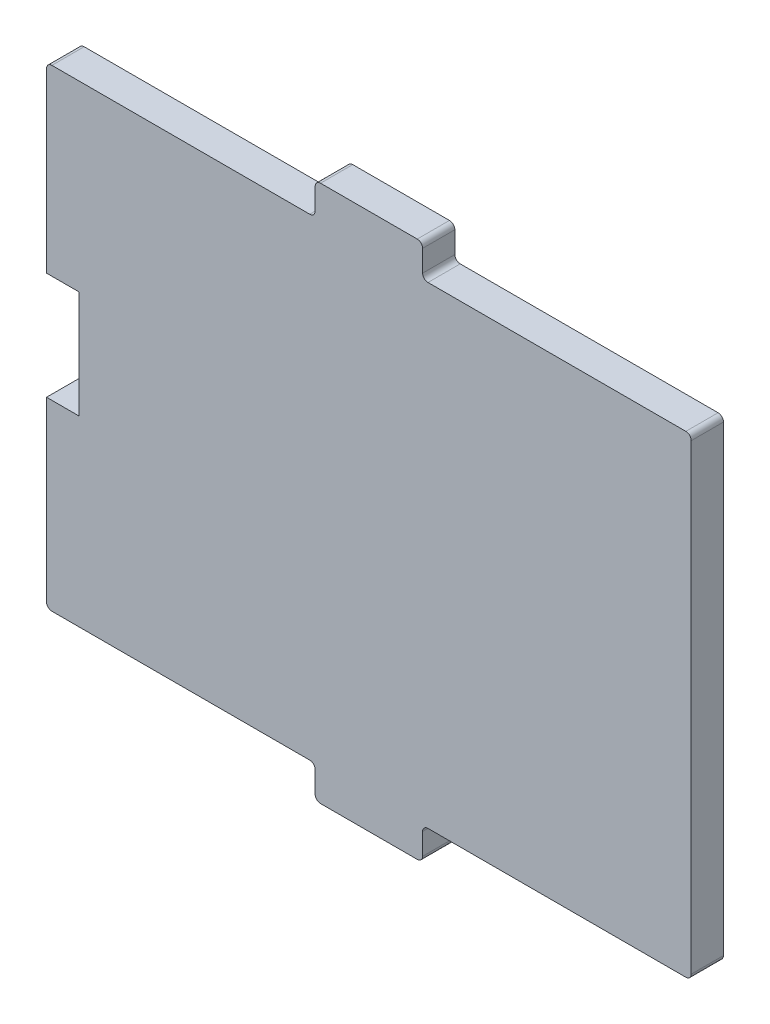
ISO-10303-21;
HEADER;
FILE_DESCRIPTION(('STEP AP214'),'2;1');
FILE_NAME('part.step','',(''),(''),'','','');
FILE_SCHEMA(('AUTOMOTIVE_DESIGN { 1 0 10303 214 1 1 1 1 }'));
ENDSEC;
DATA;
#1=APPLICATION_CONTEXT('core data for automotive mechanical design processes');
#2=APPLICATION_PROTOCOL_DEFINITION('international standard','automotive_design',2000,#1);
#3=PRODUCT_CONTEXT('',#1,'mechanical');
#4=PRODUCT('Part','Part','',(#3));
#5=PRODUCT_RELATED_PRODUCT_CATEGORY('part','',(#4));
#6=PRODUCT_DEFINITION_FORMATION('','',#4);
#7=PRODUCT_DEFINITION_CONTEXT('part definition',#1,'design');
#8=PRODUCT_DEFINITION('design','',#6,#7);
#9=PRODUCT_DEFINITION_SHAPE('','',#8);
#10=(LENGTH_UNIT() NAMED_UNIT(*) SI_UNIT(.MILLI.,.METRE.));
#11=(NAMED_UNIT(*) PLANE_ANGLE_UNIT() SI_UNIT($,.RADIAN.));
#12=(NAMED_UNIT(*) SI_UNIT($,.STERADIAN.) SOLID_ANGLE_UNIT());
#13=UNCERTAINTY_MEASURE_WITH_UNIT(LENGTH_MEASURE(1.E-05),#10,'distance_accuracy_value','');
#14=(GEOMETRIC_REPRESENTATION_CONTEXT(3) GLOBAL_UNCERTAINTY_ASSIGNED_CONTEXT((#13)) GLOBAL_UNIT_ASSIGNED_CONTEXT((#10,
#11,#12)) REPRESENTATION_CONTEXT('',''));
#15=CARTESIAN_POINT('',(0.,0.,0.));
#16=DIRECTION('',(0.,0.,1.));
#17=DIRECTION('',(1.,0.,0.));
#18=AXIS2_PLACEMENT_3D('',#15,#16,#17);
#19=CARTESIAN_POINT('',(-60.,6.,6.));
#20=DIRECTION('',(1.,0.,0.));
#21=DIRECTION('',(0.,0.,-1.));
#22=AXIS2_PLACEMENT_3D('',#19,#20,#21);
#23=PLANE('',#22);
#24=DIRECTION('',(0.,-1.,0.));
#25=VECTOR('',#24,1.);
#26=CARTESIAN_POINT('',(-60.,6.,6.));
#27=LINE('',#26,#25);
#28=CARTESIAN_POINT('',(-60.,40.,6.));
#29=VERTEX_POINT('',#28);
#30=CARTESIAN_POINT('',(-60.,7.,6.));
#31=VERTEX_POINT('',#30);
#32=EDGE_CURVE('E250',#29,#31,#27,.T.);
#33=ORIENTED_EDGE('',*,*,#32,.F.);
#34=DIRECTION('',(0.,0.,-1.));
#35=VECTOR('',#34,1.);
#36=CARTESIAN_POINT('',(-60.,40.,6.));
#37=LINE('',#36,#35);
#38=CARTESIAN_POINT('',(-60.,40.,0.));
#39=VERTEX_POINT('',#38);
#40=EDGE_CURVE('E277',#29,#39,#37,.T.);
#41=ORIENTED_EDGE('',*,*,#40,.T.);
#42=DIRECTION('',(0.,-1.,0.));
#43=VECTOR('',#42,1.);
#44=CARTESIAN_POINT('',(-60.,6.,0.));
#45=LINE('',#44,#43);
#46=CARTESIAN_POINT('',(-60.,7.,0.));
#47=VERTEX_POINT('',#46);
#48=EDGE_CURVE('E289',#39,#47,#45,.T.);
#49=ORIENTED_EDGE('',*,*,#48,.T.);
#50=DIRECTION('',(0.,0.,-1.));
#51=VECTOR('',#50,1.);
#52=CARTESIAN_POINT('',(-60.,7.,6.));
#53=LINE('',#52,#51);
#54=EDGE_CURVE('E376',#47,#31,#53,.F.);
#55=ORIENTED_EDGE('',*,*,#54,.T.);
#56=EDGE_LOOP('',(#33,#41,#49,#55));
#57=FACE_BOUND('',#56,.T.);
#58=ADVANCED_FACE('F39',(#57),#23,.F.);
#59=CARTESIAN_POINT('',(60.,94.,6.));
#60=DIRECTION('',(0.,-1.,0.));
#61=DIRECTION('',(1.,0.,0.));
#62=AXIS2_PLACEMENT_3D('',#59,#60,#61);
#63=PLANE('',#62);
#64=DIRECTION('',(-1.,0.,0.));
#65=VECTOR('',#64,1.);
#66=CARTESIAN_POINT('',(60.,94.,6.));
#67=LINE('',#66,#65);
#68=CARTESIAN_POINT('',(59.,94.,6.));
#69=VERTEX_POINT('',#68);
#70=CARTESIAN_POINT('',(11.,94.,6.));
#71=VERTEX_POINT('',#70);
#72=EDGE_CURVE('E308',#69,#71,#67,.T.);
#73=ORIENTED_EDGE('',*,*,#72,.F.);
#74=DIRECTION('',(0.,0.,-1.));
#75=VECTOR('',#74,1.);
#76=CARTESIAN_POINT('',(59.,94.,6.));
#77=LINE('',#76,#75);
#78=CARTESIAN_POINT('',(59.,94.,0.));
#79=VERTEX_POINT('',#78);
#80=EDGE_CURVE('E371',#69,#79,#77,.T.);
#81=ORIENTED_EDGE('',*,*,#80,.T.);
#82=DIRECTION('',(-1.,0.,0.));
#83=VECTOR('',#82,1.);
#84=CARTESIAN_POINT('',(60.,94.,0.));
#85=LINE('',#84,#83);
#86=CARTESIAN_POINT('',(11.,94.,0.));
#87=VERTEX_POINT('',#86);
#88=EDGE_CURVE('E273',#79,#87,#85,.T.);
#89=ORIENTED_EDGE('',*,*,#88,.T.);
#90=DIRECTION('',(0.,0.,-1.));
#91=VECTOR('',#90,1.);
#92=CARTESIAN_POINT('',(11.,94.,6.));
#93=LINE('',#92,#91);
#94=EDGE_CURVE('E369',#87,#71,#93,.F.);
#95=ORIENTED_EDGE('',*,*,#94,.T.);
#96=EDGE_LOOP('',(#73,#81,#89,#95));
#97=FACE_BOUND('',#96,.T.);
#98=ADVANCED_FACE('F420',(#97),#63,.F.);
#99=CARTESIAN_POINT('',(10.,94.,6.));
#100=DIRECTION('',(-1.,0.,0.));
#101=DIRECTION('',(0.,0.,1.));
#102=AXIS2_PLACEMENT_3D('',#99,#100,#101);
#103=PLANE('',#102);
#104=DIRECTION('',(0.,1.,0.));
#105=VECTOR('',#104,1.);
#106=CARTESIAN_POINT('',(10.,94.,0.));
#107=LINE('',#106,#105);
#108=CARTESIAN_POINT('',(10.,95.,0.));
#109=VERTEX_POINT('',#108);
#110=CARTESIAN_POINT('',(10.,99.,0.));
#111=VERTEX_POINT('',#110);
#112=EDGE_CURVE('E276',#109,#111,#107,.T.);
#113=ORIENTED_EDGE('',*,*,#112,.T.);
#114=DIRECTION('',(0.,0.,-1.));
#115=VECTOR('',#114,1.);
#116=CARTESIAN_POINT('',(10.,99.,6.));
#117=LINE('',#116,#115);
#118=CARTESIAN_POINT('',(10.,99.,6.));
#119=VERTEX_POINT('',#118);
#120=EDGE_CURVE('E397',#111,#119,#117,.F.);
#121=ORIENTED_EDGE('',*,*,#120,.T.);
#122=DIRECTION('',(0.,1.,0.));
#123=VECTOR('',#122,1.);
#124=CARTESIAN_POINT('',(10.,94.,6.));
#125=LINE('',#124,#123);
#126=CARTESIAN_POINT('',(10.,95.,6.));
#127=VERTEX_POINT('',#126);
#128=EDGE_CURVE('E426',#127,#119,#125,.T.);
#129=ORIENTED_EDGE('',*,*,#128,.F.);
#130=DIRECTION('',(0.,0.,-1.));
#131=VECTOR('',#130,1.);
#132=CARTESIAN_POINT('',(10.,95.,0.));
#133=LINE('',#132,#131);
#134=EDGE_CURVE('E394',#127,#109,#133,.T.);
#135=ORIENTED_EDGE('',*,*,#134,.T.);
#136=EDGE_LOOP('',(#113,#121,#129,#135));
#137=FACE_BOUND('',#136,.T.);
#138=ADVANCED_FACE('F429',(#137),#103,.F.);
#139=CARTESIAN_POINT('',(10.,100.,6.));
#140=DIRECTION('',(0.,-1.,0.));
#141=DIRECTION('',(0.,0.,-1.));
#142=AXIS2_PLACEMENT_3D('',#139,#140,#141);
#143=PLANE('',#142);
#144=DIRECTION('',(-1.,0.,0.));
#145=VECTOR('',#144,1.);
#146=CARTESIAN_POINT('',(10.,100.,0.));
#147=LINE('',#146,#145);
#148=CARTESIAN_POINT('',(9.,100.,0.));
#149=VERTEX_POINT('',#148);
#150=CARTESIAN_POINT('',(-9.,100.,0.));
#151=VERTEX_POINT('',#150);
#152=EDGE_CURVE('E280',#149,#151,#147,.T.);
#153=ORIENTED_EDGE('',*,*,#152,.T.);
#154=DIRECTION('',(0.,0.,-1.));
#155=VECTOR('',#154,1.);
#156=CARTESIAN_POINT('',(-9.,100.,6.));
#157=LINE('',#156,#155);
#158=CARTESIAN_POINT('',(-9.,100.,6.));
#159=VERTEX_POINT('',#158);
#160=EDGE_CURVE('E392',#151,#159,#157,.F.);
#161=ORIENTED_EDGE('',*,*,#160,.T.);
#162=DIRECTION('',(-1.,0.,0.));
#163=VECTOR('',#162,1.);
#164=CARTESIAN_POINT('',(10.,100.,6.));
#165=LINE('',#164,#163);
#166=CARTESIAN_POINT('',(9.,100.,6.));
#167=VERTEX_POINT('',#166);
#168=EDGE_CURVE('E431',#167,#159,#165,.T.);
#169=ORIENTED_EDGE('',*,*,#168,.F.);
#170=DIRECTION('',(0.,0.,-1.));
#171=VECTOR('',#170,1.);
#172=CARTESIAN_POINT('',(9.,100.,6.));
#173=LINE('',#172,#171);
#174=EDGE_CURVE('E389',#167,#149,#173,.T.);
#175=ORIENTED_EDGE('',*,*,#174,.T.);
#176=EDGE_LOOP('',(#153,#161,#169,#175));
#177=FACE_BOUND('',#176,.T.);
#178=ADVANCED_FACE('F552',(#177),#143,.F.);
#179=CARTESIAN_POINT('',(-10.,94.,6.));
#180=DIRECTION('',(1.,0.,0.));
#181=DIRECTION('',(0.,0.,-1.));
#182=AXIS2_PLACEMENT_3D('',#179,#180,#181);
#183=PLANE('',#182);
#184=DIRECTION('',(0.,-1.,0.));
#185=VECTOR('',#184,1.);
#186=CARTESIAN_POINT('',(-10.,94.,6.));
#187=LINE('',#186,#185);
#188=CARTESIAN_POINT('',(-10.,99.,6.));
#189=VERTEX_POINT('',#188);
#190=CARTESIAN_POINT('',(-10.,95.,6.));
#191=VERTEX_POINT('',#190);
#192=EDGE_CURVE('E434',#189,#191,#187,.T.);
#193=ORIENTED_EDGE('',*,*,#192,.F.);
#194=DIRECTION('',(0.,0.,-1.));
#195=VECTOR('',#194,1.);
#196=CARTESIAN_POINT('',(-10.,99.,6.));
#197=LINE('',#196,#195);
#198=CARTESIAN_POINT('',(-10.,99.,0.));
#199=VERTEX_POINT('',#198);
#200=EDGE_CURVE('E386',#189,#199,#197,.T.);
#201=ORIENTED_EDGE('',*,*,#200,.T.);
#202=DIRECTION('',(0.,-1.,0.));
#203=VECTOR('',#202,1.);
#204=CARTESIAN_POINT('',(-10.,94.,0.));
#205=LINE('',#204,#203);
#206=CARTESIAN_POINT('',(-10.,95.,0.));
#207=VERTEX_POINT('',#206);
#208=EDGE_CURVE('E283',#199,#207,#205,.T.);
#209=ORIENTED_EDGE('',*,*,#208,.T.);
#210=DIRECTION('',(0.,0.,-1.));
#211=VECTOR('',#210,1.);
#212=CARTESIAN_POINT('',(-10.,95.,6.));
#213=LINE('',#212,#211);
#214=EDGE_CURVE('E384',#207,#191,#213,.F.);
#215=ORIENTED_EDGE('',*,*,#214,.T.);
#216=EDGE_LOOP('',(#193,#201,#209,#215));
#217=FACE_BOUND('',#216,.T.);
#218=ADVANCED_FACE('F548',(#217),#183,.F.);
#219=CARTESIAN_POINT('',(-60.,94.,6.));
#220=DIRECTION('',(0.,-1.,0.));
#221=DIRECTION('',(1.,0.,0.));
#222=AXIS2_PLACEMENT_3D('',#219,#220,#221);
#223=PLANE('',#222);
#224=DIRECTION('',(-1.,0.,0.));
#225=VECTOR('',#224,1.);
#226=CARTESIAN_POINT('',(-60.,94.,0.));
#227=LINE('',#226,#225);
#228=CARTESIAN_POINT('',(-11.,94.,0.));
#229=VERTEX_POINT('',#228);
#230=CARTESIAN_POINT('',(-59.,94.,0.));
#231=VERTEX_POINT('',#230);
#232=EDGE_CURVE('E286',#229,#231,#227,.T.);
#233=ORIENTED_EDGE('',*,*,#232,.T.);
#234=DIRECTION('',(0.,0.,-1.));
#235=VECTOR('',#234,1.);
#236=CARTESIAN_POINT('',(-59.,94.,6.));
#237=LINE('',#236,#235);
#238=CARTESIAN_POINT('',(-59.,94.,6.));
#239=VERTEX_POINT('',#238);
#240=EDGE_CURVE('E382',#231,#239,#237,.F.);
#241=ORIENTED_EDGE('',*,*,#240,.T.);
#242=DIRECTION('',(-1.,0.,0.));
#243=VECTOR('',#242,1.);
#244=CARTESIAN_POINT('',(-60.,94.,6.));
#245=LINE('',#244,#243);
#246=CARTESIAN_POINT('',(-11.,94.,6.));
#247=VERTEX_POINT('',#246);
#248=EDGE_CURVE('E255',#247,#239,#245,.T.);
#249=ORIENTED_EDGE('',*,*,#248,.F.);
#250=DIRECTION('',(0.,0.,-1.));
#251=VECTOR('',#250,1.);
#252=CARTESIAN_POINT('',(-11.,94.,0.));
#253=LINE('',#252,#251);
#254=EDGE_CURVE('E379',#247,#229,#253,.T.);
#255=ORIENTED_EDGE('',*,*,#254,.T.);
#256=EDGE_LOOP('',(#233,#241,#249,#255));
#257=FACE_BOUND('',#256,.T.);
#258=ADVANCED_FACE('F542',(#257),#223,.F.);
#259=CARTESIAN_POINT('',(-60.,93.,0.));
#260=VERTEX_POINT('',#259);
#261=CARTESIAN_POINT('',(-60.,60.,0.));
#262=VERTEX_POINT('',#261);
#263=EDGE_CURVE('E242',#260,#262,#45,.T.);
#264=ORIENTED_EDGE('',*,*,#263,.T.);
#265=DIRECTION('',(0.,0.,-1.));
#266=VECTOR('',#265,1.);
#267=CARTESIAN_POINT('',(-60.,60.,6.));
#268=LINE('',#267,#266);
#269=CARTESIAN_POINT('',(-60.,60.,6.));
#270=VERTEX_POINT('',#269);
#271=EDGE_CURVE('E54',#270,#262,#268,.T.);
#272=ORIENTED_EDGE('',*,*,#271,.F.);
#273=CARTESIAN_POINT('',(-60.,93.,6.));
#274=VERTEX_POINT('',#273);
#275=EDGE_CURVE('E239',#274,#270,#27,.T.);
#276=ORIENTED_EDGE('',*,*,#275,.F.);
#277=DIRECTION('',(0.,0.,-1.));
#278=VECTOR('',#277,1.);
#279=CARTESIAN_POINT('',(-60.,93.,6.));
#280=LINE('',#279,#278);
#281=EDGE_CURVE('E374',#274,#260,#280,.T.);
#282=ORIENTED_EDGE('',*,*,#281,.T.);
#283=EDGE_LOOP('',(#264,#272,#276,#282));
#284=FACE_BOUND('',#283,.T.);
#285=ADVANCED_FACE('F237',(#284),#23,.F.);
#286=CARTESIAN_POINT('',(-10.,6.,6.));
#287=DIRECTION('',(0.,1.,0.));
#288=DIRECTION('',(-1.,0.,0.));
#289=AXIS2_PLACEMENT_3D('',#286,#287,#288);
#290=PLANE('',#289);
#291=DIRECTION('',(1.,0.,0.));
#292=VECTOR('',#291,1.);
#293=CARTESIAN_POINT('',(-10.,6.,0.));
#294=LINE('',#293,#292);
#295=CARTESIAN_POINT('',(-59.,6.,0.));
#296=VERTEX_POINT('',#295);
#297=CARTESIAN_POINT('',(-11.,6.,0.));
#298=VERTEX_POINT('',#297);
#299=EDGE_CURVE('E291',#296,#298,#294,.T.);
#300=ORIENTED_EDGE('',*,*,#299,.T.);
#301=DIRECTION('',(0.,0.,-1.));
#302=VECTOR('',#301,1.);
#303=CARTESIAN_POINT('',(-11.,6.,6.));
#304=LINE('',#303,#302);
#305=CARTESIAN_POINT('',(-11.,6.,6.));
#306=VERTEX_POINT('',#305);
#307=EDGE_CURVE('E353',#298,#306,#304,.F.);
#308=ORIENTED_EDGE('',*,*,#307,.T.);
#309=DIRECTION('',(1.,0.,0.));
#310=VECTOR('',#309,1.);
#311=CARTESIAN_POINT('',(-10.,6.,6.));
#312=LINE('',#311,#310);
#313=CARTESIAN_POINT('',(-59.,6.,6.));
#314=VERTEX_POINT('',#313);
#315=EDGE_CURVE('E249',#314,#306,#312,.T.);
#316=ORIENTED_EDGE('',*,*,#315,.F.);
#317=DIRECTION('',(0.,0.,-1.));
#318=VECTOR('',#317,1.);
#319=CARTESIAN_POINT('',(-59.,6.,6.));
#320=LINE('',#319,#318);
#321=EDGE_CURVE('E350',#314,#296,#320,.T.);
#322=ORIENTED_EDGE('',*,*,#321,.T.);
#323=EDGE_LOOP('',(#300,#308,#316,#322));
#324=FACE_BOUND('',#323,.T.);
#325=ADVANCED_FACE('F477',(#324),#290,.F.);
#326=CARTESIAN_POINT('',(-10.,0.,6.));
#327=DIRECTION('',(1.,0.,0.));
#328=DIRECTION('',(0.,0.,-1.));
#329=AXIS2_PLACEMENT_3D('',#326,#327,#328);
#330=PLANE('',#329);
#331=DIRECTION('',(0.,-1.,0.));
#332=VECTOR('',#331,1.);
#333=CARTESIAN_POINT('',(-10.,0.,0.));
#334=LINE('',#333,#332);
#335=CARTESIAN_POINT('',(-10.,5.,0.));
#336=VERTEX_POINT('',#335);
#337=CARTESIAN_POINT('',(-10.,1.,0.));
#338=VERTEX_POINT('',#337);
#339=EDGE_CURVE('E294',#336,#338,#334,.T.);
#340=ORIENTED_EDGE('',*,*,#339,.T.);
#341=DIRECTION('',(0.,0.,-1.));
#342=VECTOR('',#341,1.);
#343=CARTESIAN_POINT('',(-10.,1.,6.));
#344=LINE('',#343,#342);
#345=CARTESIAN_POINT('',(-10.,1.,6.));
#346=VERTEX_POINT('',#345);
#347=EDGE_CURVE('E333',#338,#346,#344,.F.);
#348=ORIENTED_EDGE('',*,*,#347,.T.);
#349=DIRECTION('',(0.,-1.,0.));
#350=VECTOR('',#349,1.);
#351=CARTESIAN_POINT('',(-10.,0.,6.));
#352=LINE('',#351,#350);
#353=CARTESIAN_POINT('',(-10.,5.,6.));
#354=VERTEX_POINT('',#353);
#355=EDGE_CURVE('E253',#354,#346,#352,.T.);
#356=ORIENTED_EDGE('',*,*,#355,.F.);
#357=DIRECTION('',(0.,0.,-1.));
#358=VECTOR('',#357,1.);
#359=CARTESIAN_POINT('',(-10.,5.,0.));
#360=LINE('',#359,#358);
#361=EDGE_CURVE('E330',#354,#336,#360,.T.);
#362=ORIENTED_EDGE('',*,*,#361,.T.);
#363=EDGE_LOOP('',(#340,#348,#356,#362));
#364=FACE_BOUND('',#363,.T.);
#365=ADVANCED_FACE('F486',(#364),#330,.F.);
#366=CARTESIAN_POINT('',(-10.,0.,6.));
#367=DIRECTION('',(0.,1.,0.));
#368=DIRECTION('',(0.,0.,1.));
#369=AXIS2_PLACEMENT_3D('',#366,#367,#368);
#370=PLANE('',#369);
#371=DIRECTION('',(1.,0.,0.));
#372=VECTOR('',#371,1.);
#373=CARTESIAN_POINT('',(-10.,0.,6.));
#374=LINE('',#373,#372);
#375=CARTESIAN_POINT('',(-9.,0.,6.));
#376=VERTEX_POINT('',#375);
#377=CARTESIAN_POINT('',(9.,0.,6.));
#378=VERTEX_POINT('',#377);
#379=EDGE_CURVE('E261',#376,#378,#374,.T.);
#380=ORIENTED_EDGE('',*,*,#379,.F.);
#381=DIRECTION('',(0.,0.,-1.));
#382=VECTOR('',#381,1.);
#383=CARTESIAN_POINT('',(-9.,0.,6.));
#384=LINE('',#383,#382);
#385=CARTESIAN_POINT('',(-9.,0.,0.));
#386=VERTEX_POINT('',#385);
#387=EDGE_CURVE('E310',#376,#386,#384,.T.);
#388=ORIENTED_EDGE('',*,*,#387,.T.);
#389=DIRECTION('',(1.,0.,0.));
#390=VECTOR('',#389,1.);
#391=CARTESIAN_POINT('',(-10.,0.,0.));
#392=LINE('',#391,#390);
#393=CARTESIAN_POINT('',(9.,0.,0.));
#394=VERTEX_POINT('',#393);
#395=EDGE_CURVE('E297',#386,#394,#392,.T.);
#396=ORIENTED_EDGE('',*,*,#395,.T.);
#397=DIRECTION('',(0.,0.,-1.));
#398=VECTOR('',#397,1.);
#399=CARTESIAN_POINT('',(9.,0.,6.));
#400=LINE('',#399,#398);
#401=EDGE_CURVE('E272',#394,#378,#400,.F.);
#402=ORIENTED_EDGE('',*,*,#401,.T.);
#403=EDGE_LOOP('',(#380,#388,#396,#402));
#404=FACE_BOUND('',#403,.T.);
#405=ADVANCED_FACE('F495',(#404),#370,.F.);
#406=CARTESIAN_POINT('',(10.,0.,6.));
#407=DIRECTION('',(-1.,0.,0.));
#408=DIRECTION('',(0.,0.,1.));
#409=AXIS2_PLACEMENT_3D('',#406,#407,#408);
#410=PLANE('',#409);
#411=DIRECTION('',(0.,1.,0.));
#412=VECTOR('',#411,1.);
#413=CARTESIAN_POINT('',(10.,0.,6.));
#414=LINE('',#413,#412);
#415=CARTESIAN_POINT('',(10.,1.,6.));
#416=VERTEX_POINT('',#415);
#417=CARTESIAN_POINT('',(10.,5.,6.));
#418=VERTEX_POINT('',#417);
#419=EDGE_CURVE('E264',#416,#418,#414,.T.);
#420=ORIENTED_EDGE('',*,*,#419,.F.);
#421=DIRECTION('',(0.,0.,-1.));
#422=VECTOR('',#421,1.);
#423=CARTESIAN_POINT('',(10.,1.,6.));
#424=LINE('',#423,#422);
#425=CARTESIAN_POINT('',(10.,1.,0.));
#426=VERTEX_POINT('',#425);
#427=EDGE_CURVE('E357',#416,#426,#424,.T.);
#428=ORIENTED_EDGE('',*,*,#427,.T.);
#429=DIRECTION('',(0.,1.,0.));
#430=VECTOR('',#429,1.);
#431=CARTESIAN_POINT('',(10.,0.,0.));
#432=LINE('',#431,#430);
#433=CARTESIAN_POINT('',(10.,5.,0.));
#434=VERTEX_POINT('',#433);
#435=EDGE_CURVE('E300',#426,#434,#432,.T.);
#436=ORIENTED_EDGE('',*,*,#435,.T.);
#437=DIRECTION('',(0.,0.,-1.));
#438=VECTOR('',#437,1.);
#439=CARTESIAN_POINT('',(10.,5.,6.));
#440=LINE('',#439,#438);
#441=EDGE_CURVE('E355',#434,#418,#440,.F.);
#442=ORIENTED_EDGE('',*,*,#441,.T.);
#443=EDGE_LOOP('',(#420,#428,#436,#442));
#444=FACE_BOUND('',#443,.T.);
#445=ADVANCED_FACE('F504',(#444),#410,.F.);
#446=CARTESIAN_POINT('',(10.,6.,6.));
#447=DIRECTION('',(0.,1.,0.));
#448=DIRECTION('',(-1.,0.,0.));
#449=AXIS2_PLACEMENT_3D('',#446,#447,#448);
#450=PLANE('',#449);
#451=DIRECTION('',(1.,0.,0.));
#452=VECTOR('',#451,1.);
#453=CARTESIAN_POINT('',(10.,6.,0.));
#454=LINE('',#453,#452);
#455=CARTESIAN_POINT('',(11.,6.,0.));
#456=VERTEX_POINT('',#455);
#457=CARTESIAN_POINT('',(59.,6.,0.));
#458=VERTEX_POINT('',#457);
#459=EDGE_CURVE('E303',#456,#458,#454,.T.);
#460=ORIENTED_EDGE('',*,*,#459,.T.);
#461=DIRECTION('',(0.,0.,-1.));
#462=VECTOR('',#461,1.);
#463=CARTESIAN_POINT('',(59.,6.,6.));
#464=LINE('',#463,#462);
#465=CARTESIAN_POINT('',(59.,6.,6.));
#466=VERTEX_POINT('',#465);
#467=EDGE_CURVE('E367',#458,#466,#464,.F.);
#468=ORIENTED_EDGE('',*,*,#467,.T.);
#469=DIRECTION('',(1.,0.,0.));
#470=VECTOR('',#469,1.);
#471=CARTESIAN_POINT('',(10.,6.,6.));
#472=LINE('',#471,#470);
#473=CARTESIAN_POINT('',(11.,6.,6.));
#474=VERTEX_POINT('',#473);
#475=EDGE_CURVE('E267',#474,#466,#472,.T.);
#476=ORIENTED_EDGE('',*,*,#475,.F.);
#477=DIRECTION('',(0.,0.,-1.));
#478=VECTOR('',#477,1.);
#479=CARTESIAN_POINT('',(11.,6.,0.));
#480=LINE('',#479,#478);
#481=EDGE_CURVE('E364',#474,#456,#480,.T.);
#482=ORIENTED_EDGE('',*,*,#481,.T.);
#483=EDGE_LOOP('',(#460,#468,#476,#482));
#484=FACE_BOUND('',#483,.T.);
#485=ADVANCED_FACE('F513',(#484),#450,.F.);
#486=CARTESIAN_POINT('',(60.,6.,6.));
#487=DIRECTION('',(-1.,0.,0.));
#488=DIRECTION('',(0.,0.,1.));
#489=AXIS2_PLACEMENT_3D('',#486,#487,#488);
#490=PLANE('',#489);
#491=DIRECTION('',(0.,1.,0.));
#492=VECTOR('',#491,1.);
#493=CARTESIAN_POINT('',(60.,6.,6.));
#494=LINE('',#493,#492);
#495=CARTESIAN_POINT('',(60.,7.,6.));
#496=VERTEX_POINT('',#495);
#497=CARTESIAN_POINT('',(60.,93.,6.));
#498=VERTEX_POINT('',#497);
#499=EDGE_CURVE('E270',#496,#498,#494,.T.);
#500=ORIENTED_EDGE('',*,*,#499,.F.);
#501=DIRECTION('',(0.,0.,-1.));
#502=VECTOR('',#501,1.);
#503=CARTESIAN_POINT('',(60.,7.,6.));
#504=LINE('',#503,#502);
#505=CARTESIAN_POINT('',(60.,7.,0.));
#506=VERTEX_POINT('',#505);
#507=EDGE_CURVE('E361',#496,#506,#504,.T.);
#508=ORIENTED_EDGE('',*,*,#507,.T.);
#509=DIRECTION('',(0.,1.,0.));
#510=VECTOR('',#509,1.);
#511=CARTESIAN_POINT('',(60.,6.,0.));
#512=LINE('',#511,#510);
#513=CARTESIAN_POINT('',(60.,93.,0.));
#514=VERTEX_POINT('',#513);
#515=EDGE_CURVE('E306',#506,#514,#512,.T.);
#516=ORIENTED_EDGE('',*,*,#515,.T.);
#517=DIRECTION('',(0.,0.,-1.));
#518=VECTOR('',#517,1.);
#519=CARTESIAN_POINT('',(60.,93.,6.));
#520=LINE('',#519,#518);
#521=EDGE_CURVE('E62',#514,#498,#520,.F.);
#522=ORIENTED_EDGE('',*,*,#521,.T.);
#523=EDGE_LOOP('',(#500,#508,#516,#522));
#524=FACE_BOUND('',#523,.T.);
#525=ADVANCED_FACE('F520',(#524),#490,.F.);
#526=CARTESIAN_POINT('',(0.,0.,6.));
#527=DIRECTION('',(0.,0.,-1.));
#528=DIRECTION('',(-1.,0.,0.));
#529=AXIS2_PLACEMENT_3D('',#526,#527,#528);
#530=PLANE('',#529);
#531=DIRECTION('',(0.,-1.,0.));
#532=VECTOR('',#531,1.);
#533=CARTESIAN_POINT('',(-54.,60.,6.));
#534=LINE('',#533,#532);
#535=CARTESIAN_POINT('',(-54.,60.,6.));
#536=VERTEX_POINT('',#535);
#537=CARTESIAN_POINT('',(-54.,40.,6.));
#538=VERTEX_POINT('',#537);
#539=EDGE_CURVE('E231',#536,#538,#534,.T.);
#540=ORIENTED_EDGE('',*,*,#539,.T.);
#541=DIRECTION('',(-1.,0.,0.));
#542=VECTOR('',#541,1.);
#543=CARTESIAN_POINT('',(-60.,40.,6.));
#544=LINE('',#543,#542);
#545=EDGE_CURVE('E243',#538,#29,#544,.T.);
#546=ORIENTED_EDGE('',*,*,#545,.T.);
#547=ORIENTED_EDGE('',*,*,#32,.T.);
#548=CARTESIAN_POINT('',(-59.,7.,6.));
#549=DIRECTION('',(0.,0.,-1.));
#550=DIRECTION('',(-1.,0.,0.));
#551=AXIS2_PLACEMENT_3D('',#548,#549,#550);
#552=CIRCLE('',#551,1.);
#553=EDGE_CURVE('E340',#31,#314,#552,.F.);
#554=ORIENTED_EDGE('',*,*,#553,.T.);
#555=ORIENTED_EDGE('',*,*,#315,.T.);
#556=CARTESIAN_POINT('',(-11.,5.,6.));
#557=DIRECTION('',(0.,0.,-1.));
#558=DIRECTION('',(-1.,0.,0.));
#559=AXIS2_PLACEMENT_3D('',#556,#557,#558);
#560=CIRCLE('',#559,1.);
#561=EDGE_CURVE('E401',#306,#354,#560,.T.);
#562=ORIENTED_EDGE('',*,*,#561,.T.);
#563=ORIENTED_EDGE('',*,*,#355,.T.);
#564=CARTESIAN_POINT('',(-9.,1.,6.));
#565=DIRECTION('',(0.,0.,-1.));
#566=DIRECTION('',(-1.,0.,0.));
#567=AXIS2_PLACEMENT_3D('',#564,#565,#566);
#568=CIRCLE('',#567,1.);
#569=EDGE_CURVE('E348',#346,#376,#568,.F.);
#570=ORIENTED_EDGE('',*,*,#569,.T.);
#571=ORIENTED_EDGE('',*,*,#379,.T.);
#572=CARTESIAN_POINT('',(9.,1.,6.));
#573=DIRECTION('',(0.,0.,-1.));
#574=DIRECTION('',(-1.,0.,0.));
#575=AXIS2_PLACEMENT_3D('',#572,#573,#574);
#576=CIRCLE('',#575,1.);
#577=EDGE_CURVE('E346',#378,#416,#576,.F.);
#578=ORIENTED_EDGE('',*,*,#577,.T.);
#579=ORIENTED_EDGE('',*,*,#419,.T.);
#580=CARTESIAN_POINT('',(11.,5.,6.));
#581=DIRECTION('',(0.,0.,-1.));
#582=DIRECTION('',(-1.,0.,0.));
#583=AXIS2_PLACEMENT_3D('',#580,#581,#582);
#584=CIRCLE('',#583,1.);
#585=EDGE_CURVE('E405',#418,#474,#584,.T.);
#586=ORIENTED_EDGE('',*,*,#585,.T.);
#587=ORIENTED_EDGE('',*,*,#475,.T.);
#588=CARTESIAN_POINT('',(59.,7.,6.));
#589=DIRECTION('',(0.,0.,-1.));
#590=DIRECTION('',(-1.,0.,0.));
#591=AXIS2_PLACEMENT_3D('',#588,#589,#590);
#592=CIRCLE('',#591,1.);
#593=EDGE_CURVE('E344',#466,#496,#592,.F.);
#594=ORIENTED_EDGE('',*,*,#593,.T.);
#595=ORIENTED_EDGE('',*,*,#499,.T.);
#596=CARTESIAN_POINT('',(59.,93.,6.));
#597=DIRECTION('',(0.,0.,-1.));
#598=DIRECTION('',(-1.,0.,0.));
#599=AXIS2_PLACEMENT_3D('',#596,#597,#598);
#600=CIRCLE('',#599,1.);
#601=EDGE_CURVE('E342',#498,#69,#600,.F.);
#602=ORIENTED_EDGE('',*,*,#601,.T.);
#603=ORIENTED_EDGE('',*,*,#72,.T.);
#604=CARTESIAN_POINT('',(11.,95.,6.));
#605=DIRECTION('',(0.,0.,-1.));
#606=DIRECTION('',(-1.,0.,0.));
#607=AXIS2_PLACEMENT_3D('',#604,#605,#606);
#608=CIRCLE('',#607,1.);
#609=EDGE_CURVE('E11',#71,#127,#608,.T.);
#610=ORIENTED_EDGE('',*,*,#609,.T.);
#611=ORIENTED_EDGE('',*,*,#128,.T.);
#612=CARTESIAN_POINT('',(9.,99.,6.));
#613=DIRECTION('',(0.,0.,-1.));
#614=DIRECTION('',(-1.,0.,0.));
#615=AXIS2_PLACEMENT_3D('',#612,#613,#614);
#616=CIRCLE('',#615,1.);
#617=EDGE_CURVE('E335',#119,#167,#616,.F.);
#618=ORIENTED_EDGE('',*,*,#617,.T.);
#619=ORIENTED_EDGE('',*,*,#168,.T.);
#620=CARTESIAN_POINT('',(-9.,99.,6.));
#621=DIRECTION('',(0.,0.,-1.));
#622=DIRECTION('',(-1.,0.,0.));
#623=AXIS2_PLACEMENT_3D('',#620,#621,#622);
#624=CIRCLE('',#623,1.);
#625=EDGE_CURVE('E337',#159,#189,#624,.F.);
#626=ORIENTED_EDGE('',*,*,#625,.T.);
#627=ORIENTED_EDGE('',*,*,#192,.T.);
#628=CARTESIAN_POINT('',(-11.,95.,6.));
#629=DIRECTION('',(0.,0.,-1.));
#630=DIRECTION('',(-1.,0.,0.));
#631=AXIS2_PLACEMENT_3D('',#628,#629,#630);
#632=CIRCLE('',#631,1.);
#633=EDGE_CURVE('E409',#191,#247,#632,.T.);
#634=ORIENTED_EDGE('',*,*,#633,.T.);
#635=ORIENTED_EDGE('',*,*,#248,.T.);
#636=CARTESIAN_POINT('',(-59.,93.,6.));
#637=DIRECTION('',(0.,0.,-1.));
#638=DIRECTION('',(-1.,0.,0.));
#639=AXIS2_PLACEMENT_3D('',#636,#637,#638);
#640=CIRCLE('',#639,1.);
#641=EDGE_CURVE('E248',#239,#274,#640,.F.);
#642=ORIENTED_EDGE('',*,*,#641,.T.);
#643=ORIENTED_EDGE('',*,*,#275,.T.);
#644=DIRECTION('',(1.,0.,0.));
#645=VECTOR('',#644,1.);
#646=CARTESIAN_POINT('',(-60.,60.,6.));
#647=LINE('',#646,#645);
#648=EDGE_CURVE('E224',#270,#536,#647,.T.);
#649=ORIENTED_EDGE('',*,*,#648,.T.);
#650=EDGE_LOOP('',(#540,#546,#547,#554,#555,#562,#563,#570,#571,#578,#579,#586,#587,#594,#595,
#602,#603,#610,#611,#618,#619,#626,#627,#634,#635,#642,#643,#649));
#651=FACE_BOUND('',#650,.T.);
#652=ADVANCED_FACE('F245',(#651),#530,.F.);
#653=CARTESIAN_POINT('',(0.,0.,0.));
#654=DIRECTION('',(0.,0.,-1.));
#655=DIRECTION('',(-1.,0.,0.));
#656=AXIS2_PLACEMENT_3D('',#653,#654,#655);
#657=PLANE('',#656);
#658=DIRECTION('',(-1.,0.,0.));
#659=VECTOR('',#658,1.);
#660=CARTESIAN_POINT('',(-60.,40.,0.));
#661=LINE('',#660,#659);
#662=CARTESIAN_POINT('',(-54.,40.,0.));
#663=VERTEX_POINT('',#662);
#664=EDGE_CURVE('E232',#663,#39,#661,.T.);
#665=ORIENTED_EDGE('',*,*,#664,.F.);
#666=DIRECTION('',(0.,-1.,0.));
#667=VECTOR('',#666,1.);
#668=CARTESIAN_POINT('',(-54.,60.,0.));
#669=LINE('',#668,#667);
#670=CARTESIAN_POINT('',(-54.,60.,0.));
#671=VERTEX_POINT('',#670);
#672=EDGE_CURVE('E450',#671,#663,#669,.T.);
#673=ORIENTED_EDGE('',*,*,#672,.F.);
#674=DIRECTION('',(1.,0.,0.));
#675=VECTOR('',#674,1.);
#676=CARTESIAN_POINT('',(-60.,60.,0.));
#677=LINE('',#676,#675);
#678=EDGE_CURVE('E448',#262,#671,#677,.T.);
#679=ORIENTED_EDGE('',*,*,#678,.F.);
#680=ORIENTED_EDGE('',*,*,#263,.F.);
#681=CARTESIAN_POINT('',(-59.,93.,0.));
#682=DIRECTION('',(0.,0.,-1.));
#683=DIRECTION('',(-1.,0.,0.));
#684=AXIS2_PLACEMENT_3D('',#681,#682,#683);
#685=CIRCLE('',#684,1.);
#686=EDGE_CURVE('E317',#260,#231,#685,.T.);
#687=ORIENTED_EDGE('',*,*,#686,.T.);
#688=ORIENTED_EDGE('',*,*,#232,.F.);
#689=CARTESIAN_POINT('',(-11.,95.,0.));
#690=DIRECTION('',(0.,0.,-1.));
#691=DIRECTION('',(-1.,0.,0.));
#692=AXIS2_PLACEMENT_3D('',#689,#690,#691);
#693=CIRCLE('',#692,1.);
#694=EDGE_CURVE('E407',#229,#207,#693,.F.);
#695=ORIENTED_EDGE('',*,*,#694,.T.);
#696=ORIENTED_EDGE('',*,*,#208,.F.);
#697=CARTESIAN_POINT('',(-9.,99.,0.));
#698=DIRECTION('',(0.,0.,-1.));
#699=DIRECTION('',(-1.,0.,0.));
#700=AXIS2_PLACEMENT_3D('',#697,#698,#699);
#701=CIRCLE('',#700,1.);
#702=EDGE_CURVE('E315',#199,#151,#701,.T.);
#703=ORIENTED_EDGE('',*,*,#702,.T.);
#704=ORIENTED_EDGE('',*,*,#152,.F.);
#705=CARTESIAN_POINT('',(9.,99.,0.));
#706=DIRECTION('',(0.,0.,-1.));
#707=DIRECTION('',(-1.,0.,0.));
#708=AXIS2_PLACEMENT_3D('',#705,#706,#707);
#709=CIRCLE('',#708,1.);
#710=EDGE_CURVE('E313',#149,#111,#709,.T.);
#711=ORIENTED_EDGE('',*,*,#710,.T.);
#712=ORIENTED_EDGE('',*,*,#112,.F.);
#713=CARTESIAN_POINT('',(11.,95.,0.));
#714=DIRECTION('',(0.,0.,-1.));
#715=DIRECTION('',(-1.,0.,0.));
#716=AXIS2_PLACEMENT_3D('',#713,#714,#715);
#717=CIRCLE('',#716,1.);
#718=EDGE_CURVE('E47',#109,#87,#717,.F.);
#719=ORIENTED_EDGE('',*,*,#718,.T.);
#720=ORIENTED_EDGE('',*,*,#88,.F.);
#721=CARTESIAN_POINT('',(59.,93.,0.));
#722=DIRECTION('',(0.,0.,-1.));
#723=DIRECTION('',(-1.,0.,0.));
#724=AXIS2_PLACEMENT_3D('',#721,#722,#723);
#725=CIRCLE('',#724,1.);
#726=EDGE_CURVE('E322',#79,#514,#725,.T.);
#727=ORIENTED_EDGE('',*,*,#726,.T.);
#728=ORIENTED_EDGE('',*,*,#515,.F.);
#729=CARTESIAN_POINT('',(59.,7.,0.));
#730=DIRECTION('',(0.,0.,-1.));
#731=DIRECTION('',(-1.,0.,0.));
#732=AXIS2_PLACEMENT_3D('',#729,#730,#731);
#733=CIRCLE('',#732,1.);
#734=EDGE_CURVE('E324',#506,#458,#733,.T.);
#735=ORIENTED_EDGE('',*,*,#734,.T.);
#736=ORIENTED_EDGE('',*,*,#459,.F.);
#737=CARTESIAN_POINT('',(11.,5.,0.));
#738=DIRECTION('',(0.,0.,-1.));
#739=DIRECTION('',(-1.,0.,0.));
#740=AXIS2_PLACEMENT_3D('',#737,#738,#739);
#741=CIRCLE('',#740,1.);
#742=EDGE_CURVE('E403',#456,#434,#741,.F.);
#743=ORIENTED_EDGE('',*,*,#742,.T.);
#744=ORIENTED_EDGE('',*,*,#435,.F.);
#745=CARTESIAN_POINT('',(9.,1.,0.));
#746=DIRECTION('',(0.,0.,-1.));
#747=DIRECTION('',(-1.,0.,0.));
#748=AXIS2_PLACEMENT_3D('',#745,#746,#747);
#749=CIRCLE('',#748,1.);
#750=EDGE_CURVE('E326',#426,#394,#749,.T.);
#751=ORIENTED_EDGE('',*,*,#750,.T.);
#752=ORIENTED_EDGE('',*,*,#395,.F.);
#753=CARTESIAN_POINT('',(-9.,1.,0.));
#754=DIRECTION('',(0.,0.,-1.));
#755=DIRECTION('',(-1.,0.,0.));
#756=AXIS2_PLACEMENT_3D('',#753,#754,#755);
#757=CIRCLE('',#756,1.);
#758=EDGE_CURVE('E328',#386,#338,#757,.T.);
#759=ORIENTED_EDGE('',*,*,#758,.T.);
#760=ORIENTED_EDGE('',*,*,#339,.F.);
#761=CARTESIAN_POINT('',(-11.,5.,0.));
#762=DIRECTION('',(0.,0.,-1.));
#763=DIRECTION('',(-1.,0.,0.));
#764=AXIS2_PLACEMENT_3D('',#761,#762,#763);
#765=CIRCLE('',#764,1.);
#766=EDGE_CURVE('E399',#336,#298,#765,.F.);
#767=ORIENTED_EDGE('',*,*,#766,.T.);
#768=ORIENTED_EDGE('',*,*,#299,.F.);
#769=CARTESIAN_POINT('',(-59.,7.,0.));
#770=DIRECTION('',(0.,0.,-1.));
#771=DIRECTION('',(-1.,0.,0.));
#772=AXIS2_PLACEMENT_3D('',#769,#770,#771);
#773=CIRCLE('',#772,1.);
#774=EDGE_CURVE('E319',#296,#47,#773,.T.);
#775=ORIENTED_EDGE('',*,*,#774,.T.);
#776=ORIENTED_EDGE('',*,*,#48,.F.);
#777=EDGE_LOOP('',(#665,#673,#679,#680,#687,#688,#695,#696,#703,#704,#711,#712,#719,#720,#727,
#728,#735,#736,#743,#744,#751,#752,#759,#760,#767,#768,#775,#776));
#778=FACE_BOUND('',#777,.T.);
#779=ADVANCED_FACE('F414',(#778),#657,.T.);
#780=CARTESIAN_POINT('',(-9.,1.,6.));
#781=DIRECTION('',(0.,0.,-1.));
#782=DIRECTION('',(-1.,0.,0.));
#783=AXIS2_PLACEMENT_3D('',#780,#781,#782);
#784=CYLINDRICAL_SURFACE('',#783,1.);
#785=ORIENTED_EDGE('',*,*,#569,.F.);
#786=ORIENTED_EDGE('',*,*,#347,.F.);
#787=ORIENTED_EDGE('',*,*,#758,.F.);
#788=ORIENTED_EDGE('',*,*,#387,.F.);
#789=EDGE_LOOP('',(#785,#786,#787,#788));
#790=FACE_BOUND('',#789,.T.);
#791=ADVANCED_FACE('F490',(#790),#784,.T.);
#792=CARTESIAN_POINT('',(-11.,5.,6.));
#793=DIRECTION('',(0.,0.,1.));
#794=DIRECTION('',(1.,0.,0.));
#795=AXIS2_PLACEMENT_3D('',#792,#793,#794);
#796=CYLINDRICAL_SURFACE('',#795,1.);
#797=ORIENTED_EDGE('',*,*,#561,.F.);
#798=ORIENTED_EDGE('',*,*,#307,.F.);
#799=ORIENTED_EDGE('',*,*,#766,.F.);
#800=ORIENTED_EDGE('',*,*,#361,.F.);
#801=EDGE_LOOP('',(#797,#798,#799,#800));
#802=FACE_BOUND('',#801,.T.);
#803=ADVANCED_FACE('F481',(#802),#796,.F.);
#804=CARTESIAN_POINT('',(9.,1.,6.));
#805=DIRECTION('',(0.,0.,-1.));
#806=DIRECTION('',(-1.,0.,0.));
#807=AXIS2_PLACEMENT_3D('',#804,#805,#806);
#808=CYLINDRICAL_SURFACE('',#807,1.);
#809=ORIENTED_EDGE('',*,*,#577,.F.);
#810=ORIENTED_EDGE('',*,*,#401,.F.);
#811=ORIENTED_EDGE('',*,*,#750,.F.);
#812=ORIENTED_EDGE('',*,*,#427,.F.);
#813=EDGE_LOOP('',(#809,#810,#811,#812));
#814=FACE_BOUND('',#813,.T.);
#815=ADVANCED_FACE('F499',(#814),#808,.T.);
#816=CARTESIAN_POINT('',(59.,7.,6.));
#817=DIRECTION('',(0.,0.,-1.));
#818=DIRECTION('',(-1.,0.,0.));
#819=AXIS2_PLACEMENT_3D('',#816,#817,#818);
#820=CYLINDRICAL_SURFACE('',#819,1.);
#821=ORIENTED_EDGE('',*,*,#593,.F.);
#822=ORIENTED_EDGE('',*,*,#467,.F.);
#823=ORIENTED_EDGE('',*,*,#734,.F.);
#824=ORIENTED_EDGE('',*,*,#507,.F.);
#825=EDGE_LOOP('',(#821,#822,#823,#824));
#826=FACE_BOUND('',#825,.T.);
#827=ADVANCED_FACE('F517',(#826),#820,.T.);
#828=CARTESIAN_POINT('',(11.,5.,6.));
#829=DIRECTION('',(0.,0.,1.));
#830=DIRECTION('',(1.,0.,0.));
#831=AXIS2_PLACEMENT_3D('',#828,#829,#830);
#832=CYLINDRICAL_SURFACE('',#831,1.);
#833=ORIENTED_EDGE('',*,*,#585,.F.);
#834=ORIENTED_EDGE('',*,*,#441,.F.);
#835=ORIENTED_EDGE('',*,*,#742,.F.);
#836=ORIENTED_EDGE('',*,*,#481,.F.);
#837=EDGE_LOOP('',(#833,#834,#835,#836));
#838=FACE_BOUND('',#837,.T.);
#839=ADVANCED_FACE('F508',(#838),#832,.F.);
#840=CARTESIAN_POINT('',(59.,93.,6.));
#841=DIRECTION('',(0.,0.,-1.));
#842=DIRECTION('',(-1.,0.,0.));
#843=AXIS2_PLACEMENT_3D('',#840,#841,#842);
#844=CYLINDRICAL_SURFACE('',#843,1.);
#845=ORIENTED_EDGE('',*,*,#601,.F.);
#846=ORIENTED_EDGE('',*,*,#521,.F.);
#847=ORIENTED_EDGE('',*,*,#726,.F.);
#848=ORIENTED_EDGE('',*,*,#80,.F.);
#849=EDGE_LOOP('',(#845,#846,#847,#848));
#850=FACE_BOUND('',#849,.T.);
#851=ADVANCED_FACE('F523',(#850),#844,.T.);
#852=CARTESIAN_POINT('',(-59.,7.,6.));
#853=DIRECTION('',(0.,0.,-1.));
#854=DIRECTION('',(-1.,0.,0.));
#855=AXIS2_PLACEMENT_3D('',#852,#853,#854);
#856=CYLINDRICAL_SURFACE('',#855,1.);
#857=ORIENTED_EDGE('',*,*,#553,.F.);
#858=ORIENTED_EDGE('',*,*,#54,.F.);
#859=ORIENTED_EDGE('',*,*,#774,.F.);
#860=ORIENTED_EDGE('',*,*,#321,.F.);
#861=EDGE_LOOP('',(#857,#858,#859,#860));
#862=FACE_BOUND('',#861,.T.);
#863=ADVANCED_FACE('F473',(#862),#856,.T.);
#864=CARTESIAN_POINT('',(-59.,93.,6.));
#865=DIRECTION('',(0.,0.,-1.));
#866=DIRECTION('',(-1.,0.,0.));
#867=AXIS2_PLACEMENT_3D('',#864,#865,#866);
#868=CYLINDRICAL_SURFACE('',#867,1.);
#869=ORIENTED_EDGE('',*,*,#641,.F.);
#870=ORIENTED_EDGE('',*,*,#240,.F.);
#871=ORIENTED_EDGE('',*,*,#686,.F.);
#872=ORIENTED_EDGE('',*,*,#281,.F.);
#873=EDGE_LOOP('',(#869,#870,#871,#872));
#874=FACE_BOUND('',#873,.T.);
#875=ADVANCED_FACE('F445',(#874),#868,.T.);
#876=CARTESIAN_POINT('',(-9.,99.,6.));
#877=DIRECTION('',(0.,0.,-1.));
#878=DIRECTION('',(-1.,0.,0.));
#879=AXIS2_PLACEMENT_3D('',#876,#877,#878);
#880=CYLINDRICAL_SURFACE('',#879,1.);
#881=ORIENTED_EDGE('',*,*,#625,.F.);
#882=ORIENTED_EDGE('',*,*,#160,.F.);
#883=ORIENTED_EDGE('',*,*,#702,.F.);
#884=ORIENTED_EDGE('',*,*,#200,.F.);
#885=EDGE_LOOP('',(#881,#882,#883,#884));
#886=FACE_BOUND('',#885,.T.);
#887=ADVANCED_FACE('F597',(#886),#880,.T.);
#888=CARTESIAN_POINT('',(-11.,95.,6.));
#889=DIRECTION('',(0.,0.,1.));
#890=DIRECTION('',(1.,0.,0.));
#891=AXIS2_PLACEMENT_3D('',#888,#889,#890);
#892=CYLINDRICAL_SURFACE('',#891,1.);
#893=ORIENTED_EDGE('',*,*,#633,.F.);
#894=ORIENTED_EDGE('',*,*,#214,.F.);
#895=ORIENTED_EDGE('',*,*,#694,.F.);
#896=ORIENTED_EDGE('',*,*,#254,.F.);
#897=EDGE_LOOP('',(#893,#894,#895,#896));
#898=FACE_BOUND('',#897,.T.);
#899=ADVANCED_FACE('F606',(#898),#892,.F.);
#900=CARTESIAN_POINT('',(9.,99.,6.));
#901=DIRECTION('',(0.,0.,-1.));
#902=DIRECTION('',(-1.,0.,0.));
#903=AXIS2_PLACEMENT_3D('',#900,#901,#902);
#904=CYLINDRICAL_SURFACE('',#903,1.);
#905=ORIENTED_EDGE('',*,*,#617,.F.);
#906=ORIENTED_EDGE('',*,*,#120,.F.);
#907=ORIENTED_EDGE('',*,*,#710,.F.);
#908=ORIENTED_EDGE('',*,*,#174,.F.);
#909=EDGE_LOOP('',(#905,#906,#907,#908));
#910=FACE_BOUND('',#909,.T.);
#911=ADVANCED_FACE('F616',(#910),#904,.T.);
#912=CARTESIAN_POINT('',(11.,95.,6.));
#913=DIRECTION('',(0.,0.,1.));
#914=DIRECTION('',(1.,0.,0.));
#915=AXIS2_PLACEMENT_3D('',#912,#913,#914);
#916=CYLINDRICAL_SURFACE('',#915,1.);
#917=ORIENTED_EDGE('',*,*,#609,.F.);
#918=ORIENTED_EDGE('',*,*,#94,.F.);
#919=ORIENTED_EDGE('',*,*,#718,.F.);
#920=ORIENTED_EDGE('',*,*,#134,.F.);
#921=EDGE_LOOP('',(#917,#918,#919,#920));
#922=FACE_BOUND('',#921,.T.);
#923=ADVANCED_FACE('F41',(#922),#916,.F.);
#924=CARTESIAN_POINT('',(-60.,40.,6.));
#925=DIRECTION('',(0.,-1.,0.));
#926=DIRECTION('',(0.,0.,-1.));
#927=AXIS2_PLACEMENT_3D('',#924,#925,#926);
#928=PLANE('',#927);
#929=ORIENTED_EDGE('',*,*,#664,.T.);
#930=ORIENTED_EDGE('',*,*,#40,.F.);
#931=ORIENTED_EDGE('',*,*,#545,.F.);
#932=DIRECTION('',(0.,0.,-1.));
#933=VECTOR('',#932,1.);
#934=CARTESIAN_POINT('',(-54.,40.,6.));
#935=LINE('',#934,#933);
#936=EDGE_CURVE('E459',#538,#663,#935,.T.);
#937=ORIENTED_EDGE('',*,*,#936,.T.);
#938=EDGE_LOOP('',(#929,#930,#931,#937));
#939=FACE_BOUND('',#938,.T.);
#940=ADVANCED_FACE('F633',(#939),#928,.F.);
#941=CARTESIAN_POINT('',(-54.,60.,6.));
#942=DIRECTION('',(1.,0.,0.));
#943=DIRECTION('',(0.,1.,0.));
#944=AXIS2_PLACEMENT_3D('',#941,#942,#943);
#945=PLANE('',#944);
#946=ORIENTED_EDGE('',*,*,#672,.T.);
#947=ORIENTED_EDGE('',*,*,#936,.F.);
#948=ORIENTED_EDGE('',*,*,#539,.F.);
#949=DIRECTION('',(0.,0.,-1.));
#950=VECTOR('',#949,1.);
#951=CARTESIAN_POINT('',(-54.,60.,6.));
#952=LINE('',#951,#950);
#953=EDGE_CURVE('E226',#536,#671,#952,.T.);
#954=ORIENTED_EDGE('',*,*,#953,.T.);
#955=EDGE_LOOP('',(#946,#947,#948,#954));
#956=FACE_BOUND('',#955,.T.);
#957=ADVANCED_FACE('F462',(#956),#945,.F.);
#958=CARTESIAN_POINT('',(-60.,60.,6.));
#959=DIRECTION('',(0.,1.,0.));
#960=DIRECTION('',(-1.,0.,0.));
#961=AXIS2_PLACEMENT_3D('',#958,#959,#960);
#962=PLANE('',#961);
#963=ORIENTED_EDGE('',*,*,#678,.T.);
#964=ORIENTED_EDGE('',*,*,#953,.F.);
#965=ORIENTED_EDGE('',*,*,#648,.F.);
#966=ORIENTED_EDGE('',*,*,#271,.T.);
#967=EDGE_LOOP('',(#963,#964,#965,#966));
#968=FACE_BOUND('',#967,.T.);
#969=ADVANCED_FACE('F225',(#968),#962,.F.);
#970=CLOSED_SHELL('',(#58,#98,#138,#178,#218,#258,#285,#325,#365,#405,#445,#485,#525,#652,#779,
#791,#803,#815,#827,#839,#851,#863,#875,#887,#899,#911,#923,#940,#957,#969));
#971=MANIFOLD_SOLID_BREP('B2',#970);
#972=ADVANCED_BREP_SHAPE_REPRESENTATION('',(#18,#971),#14);
#973=SHAPE_DEFINITION_REPRESENTATION(#9,#972);
ENDSEC;
END-ISO-10303-21;
